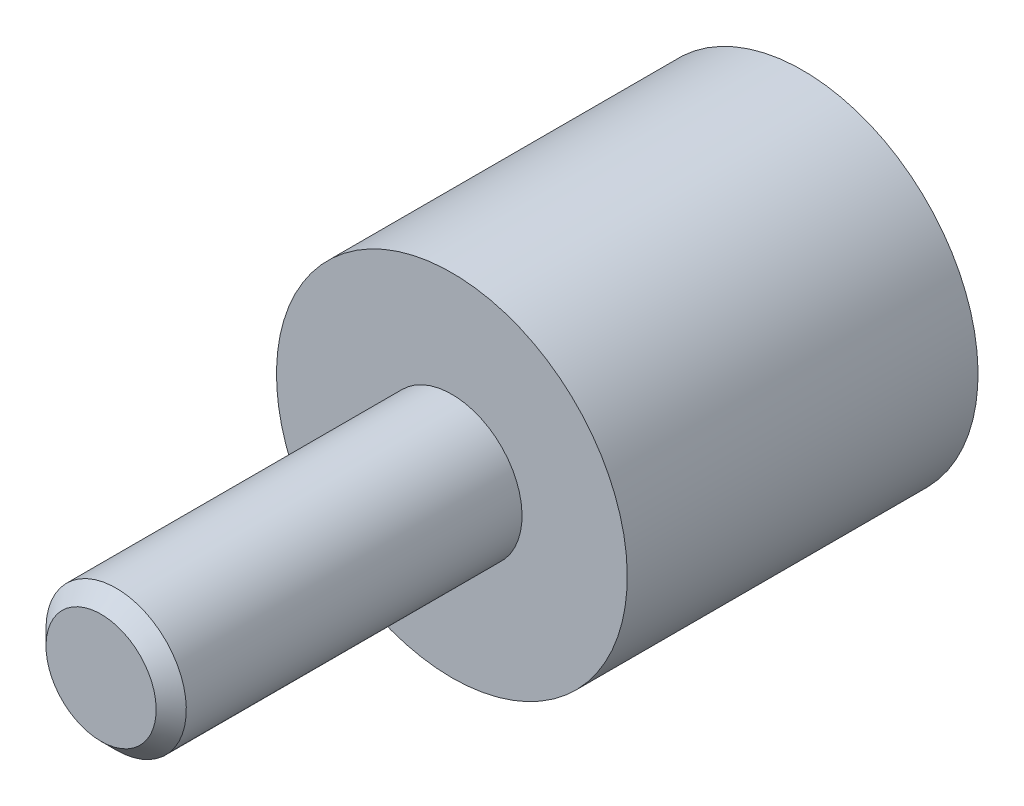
ISO-10303-21;
HEADER;
FILE_DESCRIPTION(('STEP AP214'),'2;1');
FILE_NAME('part.step','',(''),(''),'','','');
FILE_SCHEMA(('AUTOMOTIVE_DESIGN { 1 0 10303 214 1 1 1 1 }'));
ENDSEC;
DATA;
#1=APPLICATION_CONTEXT('core data for automotive mechanical design processes');
#2=APPLICATION_PROTOCOL_DEFINITION('international standard','automotive_design',2000,#1);
#3=PRODUCT_CONTEXT('',#1,'mechanical');
#4=PRODUCT('Part','Part','',(#3));
#5=PRODUCT_RELATED_PRODUCT_CATEGORY('part','',(#4));
#6=PRODUCT_DEFINITION_FORMATION('','',#4);
#7=PRODUCT_DEFINITION_CONTEXT('part definition',#1,'design');
#8=PRODUCT_DEFINITION('design','',#6,#7);
#9=PRODUCT_DEFINITION_SHAPE('','',#8);
#10=(LENGTH_UNIT() NAMED_UNIT(*) SI_UNIT(.MILLI.,.METRE.));
#11=(NAMED_UNIT(*) PLANE_ANGLE_UNIT() SI_UNIT($,.RADIAN.));
#12=(NAMED_UNIT(*) SI_UNIT($,.STERADIAN.) SOLID_ANGLE_UNIT());
#13=UNCERTAINTY_MEASURE_WITH_UNIT(LENGTH_MEASURE(1.E-05),#10,'distance_accuracy_value','');
#14=(GEOMETRIC_REPRESENTATION_CONTEXT(3) GLOBAL_UNCERTAINTY_ASSIGNED_CONTEXT((#13)) GLOBAL_UNIT_ASSIGNED_CONTEXT((#10,
#11,#12)) REPRESENTATION_CONTEXT('',''));
#15=CARTESIAN_POINT('',(0.,0.,0.));
#16=DIRECTION('',(0.,0.,1.));
#17=DIRECTION('',(1.,0.,0.));
#18=AXIS2_PLACEMENT_3D('',#15,#16,#17);
#19=CARTESIAN_POINT('',(4.6666666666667,0.,10.));
#20=DIRECTION('',(0.,0.,1.));
#21=DIRECTION('',(0.,-1.,0.));
#22=AXIS2_PLACEMENT_3D('',#19,#20,#21);
#23=PLANE('',#22);
#24=CARTESIAN_POINT('',(0.,0.,10.));
#25=DIRECTION('',(0.,0.,1.));
#26=DIRECTION('',(0.,-1.,0.));
#27=AXIS2_PLACEMENT_3D('',#24,#25,#26);
#28=CIRCLE('',#27,2.);
#29=CARTESIAN_POINT('',(0.,-2.,10.));
#30=VERTEX_POINT('',#29);
#31=EDGE_CURVE('E23',#30,#30,#28,.T.);
#32=ORIENTED_EDGE('',*,*,#31,.F.);
#33=EDGE_LOOP('',(#32));
#34=FACE_BOUND('',#33,.T.);
#35=CARTESIAN_POINT('',(0.,0.,10.));
#36=DIRECTION('',(0.,0.,1.));
#37=DIRECTION('',(0.,-1.,0.));
#38=AXIS2_PLACEMENT_3D('',#35,#36,#37);
#39=CIRCLE('',#38,5.);
#40=CARTESIAN_POINT('',(0.,-5.,10.));
#41=VERTEX_POINT('',#40);
#42=EDGE_CURVE('E27',#41,#41,#39,.T.);
#43=ORIENTED_EDGE('',*,*,#42,.T.);
#44=EDGE_LOOP('',(#43));
#45=FACE_BOUND('',#44,.T.);
#46=ADVANCED_FACE('F12',(#34,#45),#23,.T.);
#47=CARTESIAN_POINT('',(0.,0.,0.33333333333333));
#48=DIRECTION('',(0.,0.,1.));
#49=DIRECTION('',(0.,-1.,0.));
#50=AXIS2_PLACEMENT_3D('',#47,#48,#49);
#51=CYLINDRICAL_SURFACE('',#50,5.);
#52=CARTESIAN_POINT('',(0.,0.,0.));
#53=DIRECTION('',(0.,0.,1.));
#54=DIRECTION('',(0.,-1.,0.));
#55=AXIS2_PLACEMENT_3D('',#52,#53,#54);
#56=CIRCLE('',#55,5.);
#57=CARTESIAN_POINT('',(0.,-5.,0.));
#58=VERTEX_POINT('',#57);
#59=EDGE_CURVE('E32',#58,#58,#56,.T.);
#60=ORIENTED_EDGE('',*,*,#59,.T.);
#61=EDGE_LOOP('',(#60));
#62=FACE_BOUND('',#61,.T.);
#63=ORIENTED_EDGE('',*,*,#42,.F.);
#64=EDGE_LOOP('',(#63));
#65=FACE_BOUND('',#64,.T.);
#66=ADVANCED_FACE('F63',(#62,#65),#51,.T.);
#67=CARTESIAN_POINT('',(5.,0.,0.));
#68=DIRECTION('',(0.,0.,-1.));
#69=DIRECTION('',(0.,1.,0.));
#70=AXIS2_PLACEMENT_3D('',#67,#68,#69);
#71=PLANE('',#70);
#72=CARTESIAN_POINT('',(0.,0.,0.));
#73=DIRECTION('',(0.,0.,-1.));
#74=DIRECTION('',(0.,1.,0.));
#75=AXIS2_PLACEMENT_3D('',#72,#73,#74);
#76=CIRCLE('',#75,2.4);
#77=CARTESIAN_POINT('',(0.,2.4,0.));
#78=VERTEX_POINT('',#77);
#79=EDGE_CURVE('E8',#78,#78,#76,.F.);
#80=ORIENTED_EDGE('',*,*,#79,.T.);
#81=EDGE_LOOP('',(#80));
#82=FACE_BOUND('',#81,.T.);
#83=ORIENTED_EDGE('',*,*,#59,.F.);
#84=EDGE_LOOP('',(#83));
#85=FACE_BOUND('',#84,.T.);
#86=ADVANCED_FACE('F68',(#82,#85),#71,.T.);
#87=CARTESIAN_POINT('',(0.,0.,20.));
#88=DIRECTION('',(0.,0.,1.));
#89=DIRECTION('',(0.,-1.,0.));
#90=AXIS2_PLACEMENT_3D('',#87,#88,#89);
#91=PLANE('',#90);
#92=CARTESIAN_POINT('',(0.,0.,20.));
#93=DIRECTION('',(0.,0.,1.));
#94=DIRECTION('',(0.,-1.,0.));
#95=AXIS2_PLACEMENT_3D('',#92,#93,#94);
#96=CIRCLE('',#95,1.5705);
#97=CARTESIAN_POINT('',(0.,-1.5705,20.));
#98=VERTEX_POINT('',#97);
#99=EDGE_CURVE('E35',#98,#98,#96,.T.);
#100=ORIENTED_EDGE('',*,*,#99,.T.);
#101=EDGE_LOOP('',(#100));
#102=FACE_BOUND('',#101,.T.);
#103=ADVANCED_FACE('F74',(#102),#91,.T.);
#104=CARTESIAN_POINT('',(0.,0.,20.));
#105=DIRECTION('',(0.,0.,-1.));
#106=DIRECTION('',(0.,1.,0.));
#107=AXIS2_PLACEMENT_3D('',#104,#105,#106);
#108=CONICAL_SURFACE('',#107,1.5705,0.785398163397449);
#109=CARTESIAN_POINT('',(0.,0.,19.5705));
#110=DIRECTION('',(0.,0.,1.));
#111=DIRECTION('',(0.,-1.,0.));
#112=AXIS2_PLACEMENT_3D('',#109,#110,#111);
#113=CIRCLE('',#112,2.);
#114=CARTESIAN_POINT('',(0.,-2.,19.5705));
#115=VERTEX_POINT('',#114);
#116=EDGE_CURVE('E38',#115,#115,#113,.T.);
#117=ORIENTED_EDGE('',*,*,#116,.T.);
#118=EDGE_LOOP('',(#117));
#119=FACE_BOUND('',#118,.T.);
#120=ORIENTED_EDGE('',*,*,#99,.F.);
#121=EDGE_LOOP('',(#120));
#122=FACE_BOUND('',#121,.T.);
#123=ADVANCED_FACE('F57',(#119,#122),#108,.T.);
#124=CARTESIAN_POINT('',(0.,0.,10.));
#125=DIRECTION('',(0.,0.,1.));
#126=DIRECTION('',(0.,-1.,0.));
#127=AXIS2_PLACEMENT_3D('',#124,#125,#126);
#128=CYLINDRICAL_SURFACE('',#127,2.);
#129=ORIENTED_EDGE('',*,*,#31,.T.);
#130=EDGE_LOOP('',(#129));
#131=FACE_BOUND('',#130,.T.);
#132=ORIENTED_EDGE('',*,*,#116,.F.);
#133=EDGE_LOOP('',(#132));
#134=FACE_BOUND('',#133,.T.);
#135=ADVANCED_FACE('F49',(#131,#134),#128,.T.);
#136=CARTESIAN_POINT('',(0.,0.,0.));
#137=DIRECTION('',(0.,0.,1.));
#138=DIRECTION('',(0.,-1.,0.));
#139=AXIS2_PLACEMENT_3D('',#136,#137,#138);
#140=CYLINDRICAL_SURFACE('',#139,2.);
#141=CARTESIAN_POINT('',(0.,0.,0.399999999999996));
#142=DIRECTION('',(0.,0.,-1.));
#143=DIRECTION('',(0.,1.,0.));
#144=AXIS2_PLACEMENT_3D('',#141,#142,#143);
#145=CIRCLE('',#144,2.);
#146=CARTESIAN_POINT('',(0.,2.,0.399999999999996));
#147=VERTEX_POINT('',#146);
#148=EDGE_CURVE('E19',#147,#147,#145,.T.);
#149=ORIENTED_EDGE('',*,*,#148,.T.);
#150=EDGE_LOOP('',(#149));
#151=FACE_BOUND('',#150,.T.);
#152=CARTESIAN_POINT('',(0.,0.,4.));
#153=DIRECTION('',(0.,0.,-1.));
#154=DIRECTION('',(0.,1.,0.));
#155=AXIS2_PLACEMENT_3D('',#152,#153,#154);
#156=CIRCLE('',#155,2.);
#157=CARTESIAN_POINT('',(0.,2.,4.));
#158=VERTEX_POINT('',#157);
#159=EDGE_CURVE('E41',#158,#158,#156,.T.);
#160=ORIENTED_EDGE('',*,*,#159,.F.);
#161=EDGE_LOOP('',(#160));
#162=FACE_BOUND('',#161,.T.);
#163=ADVANCED_FACE('F47',(#151,#162),#140,.F.);
#164=CARTESIAN_POINT('',(0.,0.,4.));
#165=DIRECTION('',(0.,0.,-1.));
#166=DIRECTION('',(0.,1.,0.));
#167=AXIS2_PLACEMENT_3D('',#164,#165,#166);
#168=PLANE('',#167);
#169=ORIENTED_EDGE('',*,*,#159,.T.);
#170=EDGE_LOOP('',(#169));
#171=FACE_BOUND('',#170,.T.);
#172=ADVANCED_FACE('F45',(#171),#168,.T.);
#173=CARTESIAN_POINT('',(0.,0.,0.399999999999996));
#174=DIRECTION('',(0.,0.,-1.));
#175=DIRECTION('',(0.,1.,0.));
#176=AXIS2_PLACEMENT_3D('',#173,#174,#175);
#177=CONICAL_SURFACE('',#176,2.,0.785398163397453);
#178=ORIENTED_EDGE('',*,*,#79,.F.);
#179=EDGE_LOOP('',(#178));
#180=FACE_BOUND('',#179,.T.);
#181=ORIENTED_EDGE('',*,*,#148,.F.);
#182=EDGE_LOOP('',(#181));
#183=FACE_BOUND('',#182,.T.);
#184=ADVANCED_FACE('F14',(#180,#183),#177,.F.);
#185=CLOSED_SHELL('',(#46,#66,#86,#103,#123,#135,#163,#172,#184));
#186=MANIFOLD_SOLID_BREP('B1',#185);
#187=ADVANCED_BREP_SHAPE_REPRESENTATION('',(#18,#186),#14);
#188=SHAPE_DEFINITION_REPRESENTATION(#9,#187);
ENDSEC;
END-ISO-10303-21;
